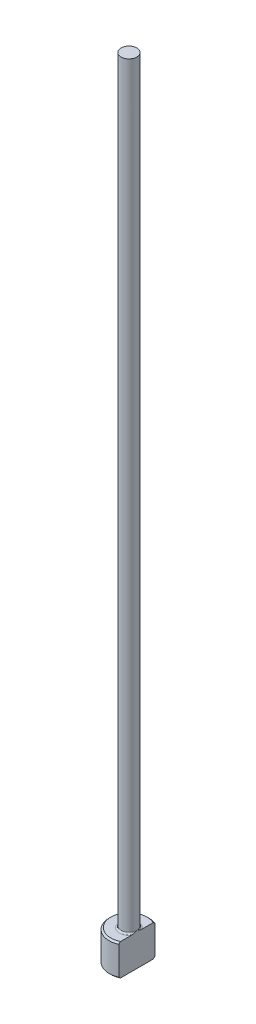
from build123d import *
from build123d.topology import SkipClean

# Parameters (mm, degrees)
CHAMFER1_SIZE    = 0.2
FILLET1_R        = 0.2
KEYED_HEAD_DEPTH = 101.062480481


with BuildPart() as part:
    # Sketch1 → Revolve1 (revolve)
    with BuildSketch(Plane.XY, mode=Mode.PRIVATE) as revolve1_sk:
        Polygon((0, 0), (-2.5, 0), (-2.5, 4), (-1, 4), (-1, 100), (0, 100), align=None)
    revolve(revolve1_sk.sketch.rotate(Axis((0, 259.958771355, 0), (0, -1, 0)), 270), axis=Axis((0, 259.958771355, 0), (0, -1, 0)))

    # Chamfer1
    chamfer1_edges = [part.edges().sort_by_distance(p)[0] for p in [
        (0, 4, -2.5),
        (0, 0, -2.5),
    ]]
    chamfer(chamfer1_edges, length=CHAMFER1_SIZE)

    # Fillet1
    fillet1_edges = [part.edges().sort_by_distance(p)[0] for p in [
        (0, 4, -1),
    ]]
    fillet(fillet1_edges, radius=FILLET1_R)

    # Sketch2 → KEYED HEAD (cut, through all)
    with SkipClean():  # the faces are left unmerged after this step: merging them gives an invalid solid
        with BuildSketch(Plane(origin=(0, 0, 0), x_dir=(1, 0, 0), z_dir=(0, 1, 0))):
            with BuildLine():
                Line((1, -2.291287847), (1, 2.291287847))
                ThreePointArc((1, 2.291287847), (2.5, 0), (1, -2.291287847))
            make_face()
        extrude(amount=KEYED_HEAD_DEPTH, mode=Mode.SUBTRACT)


solid = part.part
